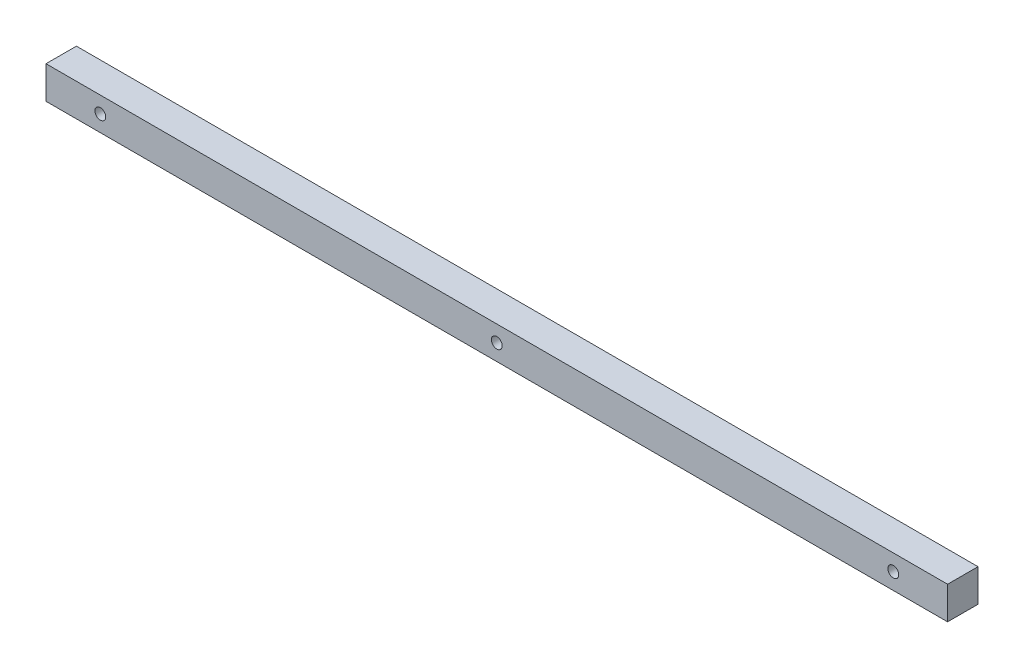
ISO-10303-21;
HEADER;
FILE_DESCRIPTION(('STEP AP214'),'2;1');
FILE_NAME('part.step','',(''),(''),'','','');
FILE_SCHEMA(('AUTOMOTIVE_DESIGN { 1 0 10303 214 1 1 1 1 }'));
ENDSEC;
DATA;
#1=APPLICATION_CONTEXT('core data for automotive mechanical design processes');
#2=APPLICATION_PROTOCOL_DEFINITION('international standard','automotive_design',2000,#1);
#3=PRODUCT_CONTEXT('',#1,'mechanical');
#4=PRODUCT('Part','Part','',(#3));
#5=PRODUCT_RELATED_PRODUCT_CATEGORY('part','',(#4));
#6=PRODUCT_DEFINITION_FORMATION('','',#4);
#7=PRODUCT_DEFINITION_CONTEXT('part definition',#1,'design');
#8=PRODUCT_DEFINITION('design','',#6,#7);
#9=PRODUCT_DEFINITION_SHAPE('','',#8);
#10=(LENGTH_UNIT() NAMED_UNIT(*) SI_UNIT(.MILLI.,.METRE.));
#11=(NAMED_UNIT(*) PLANE_ANGLE_UNIT() SI_UNIT($,.RADIAN.));
#12=(NAMED_UNIT(*) SI_UNIT($,.STERADIAN.) SOLID_ANGLE_UNIT());
#13=UNCERTAINTY_MEASURE_WITH_UNIT(LENGTH_MEASURE(1.E-05),#10,'distance_accuracy_value','');
#14=(GEOMETRIC_REPRESENTATION_CONTEXT(3) GLOBAL_UNCERTAINTY_ASSIGNED_CONTEXT((#13)) GLOBAL_UNIT_ASSIGNED_CONTEXT((#10,
#11,#12)) REPRESENTATION_CONTEXT('',''));
#15=CARTESIAN_POINT('',(0.,0.,0.));
#16=DIRECTION('',(0.,0.,1.));
#17=DIRECTION('',(1.,0.,0.));
#18=AXIS2_PLACEMENT_3D('',#15,#16,#17);
#19=CARTESIAN_POINT('',(0.,0.,28.));
#20=DIRECTION('',(0.,0.,1.));
#21=DIRECTION('',(1.,0.,0.));
#22=AXIS2_PLACEMENT_3D('',#19,#20,#21);
#23=PLANE('',#22);
#24=CARTESIAN_POINT('',(-365.,0.,28.));
#25=DIRECTION('',(0.,0.,1.));
#26=DIRECTION('',(1.,0.,0.));
#27=AXIS2_PLACEMENT_3D('',#24,#25,#26);
#28=CIRCLE('',#27,5.00000000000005);
#29=CARTESIAN_POINT('',(-360.,0.,28.));
#30=VERTEX_POINT('',#29);
#31=EDGE_CURVE('E132',#30,#30,#28,.T.);
#32=ORIENTED_EDGE('',*,*,#31,.F.);
#33=EDGE_LOOP('',(#32));
#34=FACE_BOUND('',#33,.T.);
#35=DIRECTION('',(0.,-1.,0.));
#36=VECTOR('',#35,1.);
#37=CARTESIAN_POINT('',(-415.,15.,28.));
#38=LINE('',#37,#36);
#39=CARTESIAN_POINT('',(-415.,15.,28.));
#40=VERTEX_POINT('',#39);
#41=CARTESIAN_POINT('',(-415.,-15.,28.));
#42=VERTEX_POINT('',#41);
#43=EDGE_CURVE('E92',#40,#42,#38,.T.);
#44=ORIENTED_EDGE('',*,*,#43,.T.);
#45=DIRECTION('',(1.,0.,0.));
#46=VECTOR('',#45,1.);
#47=CARTESIAN_POINT('',(-415.,-15.,28.));
#48=LINE('',#47,#46);
#49=CARTESIAN_POINT('',(415.,-15.,28.));
#50=VERTEX_POINT('',#49);
#51=EDGE_CURVE('E87',#42,#50,#48,.T.);
#52=ORIENTED_EDGE('',*,*,#51,.T.);
#53=DIRECTION('',(0.,1.,0.));
#54=VECTOR('',#53,1.);
#55=CARTESIAN_POINT('',(415.,15.,28.));
#56=LINE('',#55,#54);
#57=CARTESIAN_POINT('',(415.,15.,28.));
#58=VERTEX_POINT('',#57);
#59=EDGE_CURVE('E90',#50,#58,#56,.T.);
#60=ORIENTED_EDGE('',*,*,#59,.T.);
#61=DIRECTION('',(-1.,0.,0.));
#62=VECTOR('',#61,1.);
#63=CARTESIAN_POINT('',(-415.,15.,28.));
#64=LINE('',#63,#62);
#65=EDGE_CURVE('E57',#58,#40,#64,.T.);
#66=ORIENTED_EDGE('',*,*,#65,.T.);
#67=EDGE_LOOP('',(#44,#52,#60,#66));
#68=FACE_BOUND('',#67,.T.);
#69=CARTESIAN_POINT('',(365.,0.,28.));
#70=DIRECTION('',(0.,0.,1.));
#71=DIRECTION('',(1.,0.,0.));
#72=AXIS2_PLACEMENT_3D('',#69,#70,#71);
#73=CIRCLE('',#72,4.99999999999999);
#74=CARTESIAN_POINT('',(370.,0.,28.));
#75=VERTEX_POINT('',#74);
#76=EDGE_CURVE('E111',#75,#75,#73,.T.);
#77=ORIENTED_EDGE('',*,*,#76,.F.);
#78=EDGE_LOOP('',(#77));
#79=FACE_BOUND('',#78,.T.);
#80=CARTESIAN_POINT('',(0.,0.,28.));
#81=DIRECTION('',(0.,0.,1.));
#82=DIRECTION('',(1.,0.,0.));
#83=AXIS2_PLACEMENT_3D('',#80,#81,#82);
#84=CIRCLE('',#83,5.);
#85=CARTESIAN_POINT('',(5.00000000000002,0.,28.));
#86=VERTEX_POINT('',#85);
#87=EDGE_CURVE('E139',#86,#86,#84,.T.);
#88=ORIENTED_EDGE('',*,*,#87,.F.);
#89=EDGE_LOOP('',(#88));
#90=FACE_BOUND('',#89,.T.);
#91=ADVANCED_FACE('F39',(#34,#68,#79,#90),#23,.T.);
#92=CARTESIAN_POINT('',(0.,0.,0.));
#93=DIRECTION('',(0.,0.,1.));
#94=DIRECTION('',(1.,0.,0.));
#95=AXIS2_PLACEMENT_3D('',#92,#93,#94);
#96=PLANE('',#95);
#97=DIRECTION('',(0.,-1.,0.));
#98=VECTOR('',#97,1.);
#99=CARTESIAN_POINT('',(-415.,15.,0.));
#100=LINE('',#99,#98);
#101=CARTESIAN_POINT('',(-415.,15.,0.));
#102=VERTEX_POINT('',#101);
#103=CARTESIAN_POINT('',(-415.,-15.,0.));
#104=VERTEX_POINT('',#103);
#105=EDGE_CURVE('E107',#102,#104,#100,.T.);
#106=ORIENTED_EDGE('',*,*,#105,.F.);
#107=DIRECTION('',(-1.,0.,0.));
#108=VECTOR('',#107,1.);
#109=CARTESIAN_POINT('',(-415.,15.,0.));
#110=LINE('',#109,#108);
#111=CARTESIAN_POINT('',(415.,15.,0.));
#112=VERTEX_POINT('',#111);
#113=EDGE_CURVE('E80',#112,#102,#110,.T.);
#114=ORIENTED_EDGE('',*,*,#113,.F.);
#115=DIRECTION('',(0.,1.,0.));
#116=VECTOR('',#115,1.);
#117=CARTESIAN_POINT('',(415.,15.,0.));
#118=LINE('',#117,#116);
#119=CARTESIAN_POINT('',(415.,-15.,0.));
#120=VERTEX_POINT('',#119);
#121=EDGE_CURVE('E74',#120,#112,#118,.T.);
#122=ORIENTED_EDGE('',*,*,#121,.F.);
#123=DIRECTION('',(1.,0.,0.));
#124=VECTOR('',#123,1.);
#125=CARTESIAN_POINT('',(-415.,-15.,0.));
#126=LINE('',#125,#124);
#127=EDGE_CURVE('E97',#104,#120,#126,.T.);
#128=ORIENTED_EDGE('',*,*,#127,.F.);
#129=EDGE_LOOP('',(#106,#114,#122,#128));
#130=FACE_BOUND('',#129,.T.);
#131=CARTESIAN_POINT('',(365.,0.,0.));
#132=DIRECTION('',(0.,0.,1.));
#133=DIRECTION('',(1.,0.,0.));
#134=AXIS2_PLACEMENT_3D('',#131,#132,#133);
#135=CIRCLE('',#134,4.99999999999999);
#136=CARTESIAN_POINT('',(370.,0.,0.));
#137=VERTEX_POINT('',#136);
#138=EDGE_CURVE('E129',#137,#137,#135,.T.);
#139=ORIENTED_EDGE('',*,*,#138,.T.);
#140=EDGE_LOOP('',(#139));
#141=FACE_BOUND('',#140,.T.);
#142=CARTESIAN_POINT('',(-365.,0.,0.));
#143=DIRECTION('',(0.,0.,1.));
#144=DIRECTION('',(1.,0.,0.));
#145=AXIS2_PLACEMENT_3D('',#142,#143,#144);
#146=CIRCLE('',#145,5.00000000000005);
#147=CARTESIAN_POINT('',(-360.,0.,0.));
#148=VERTEX_POINT('',#147);
#149=EDGE_CURVE('E135',#148,#148,#146,.T.);
#150=ORIENTED_EDGE('',*,*,#149,.T.);
#151=EDGE_LOOP('',(#150));
#152=FACE_BOUND('',#151,.T.);
#153=CARTESIAN_POINT('',(0.,0.,0.));
#154=DIRECTION('',(0.,0.,1.));
#155=DIRECTION('',(1.,0.,0.));
#156=AXIS2_PLACEMENT_3D('',#153,#154,#155);
#157=CIRCLE('',#156,5.);
#158=CARTESIAN_POINT('',(5.00000000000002,0.,0.));
#159=VERTEX_POINT('',#158);
#160=EDGE_CURVE('E143',#159,#159,#157,.T.);
#161=ORIENTED_EDGE('',*,*,#160,.T.);
#162=EDGE_LOOP('',(#161));
#163=FACE_BOUND('',#162,.T.);
#164=ADVANCED_FACE('F122',(#130,#141,#152,#163),#96,.F.);
#165=CARTESIAN_POINT('',(-415.,15.,28.));
#166=DIRECTION('',(1.,0.,0.));
#167=DIRECTION('',(0.,0.,-1.));
#168=AXIS2_PLACEMENT_3D('',#165,#166,#167);
#169=PLANE('',#168);
#170=ORIENTED_EDGE('',*,*,#105,.T.);
#171=DIRECTION('',(0.,0.,-1.));
#172=VECTOR('',#171,1.);
#173=CARTESIAN_POINT('',(-415.,-15.,28.));
#174=LINE('',#173,#172);
#175=EDGE_CURVE('E11',#42,#104,#174,.T.);
#176=ORIENTED_EDGE('',*,*,#175,.F.);
#177=ORIENTED_EDGE('',*,*,#43,.F.);
#178=DIRECTION('',(0.,0.,-1.));
#179=VECTOR('',#178,1.);
#180=CARTESIAN_POINT('',(-415.,15.,28.));
#181=LINE('',#180,#179);
#182=EDGE_CURVE('E103',#40,#102,#181,.T.);
#183=ORIENTED_EDGE('',*,*,#182,.T.);
#184=EDGE_LOOP('',(#170,#176,#177,#183));
#185=FACE_BOUND('',#184,.T.);
#186=ADVANCED_FACE('F41',(#185),#169,.F.);
#187=CARTESIAN_POINT('',(-415.,-15.,28.));
#188=DIRECTION('',(0.,1.,0.));
#189=DIRECTION('',(0.,0.,1.));
#190=AXIS2_PLACEMENT_3D('',#187,#188,#189);
#191=PLANE('',#190);
#192=ORIENTED_EDGE('',*,*,#127,.T.);
#193=DIRECTION('',(0.,0.,-1.));
#194=VECTOR('',#193,1.);
#195=CARTESIAN_POINT('',(415.,-15.,28.));
#196=LINE('',#195,#194);
#197=EDGE_CURVE('E49',#50,#120,#196,.T.);
#198=ORIENTED_EDGE('',*,*,#197,.F.);
#199=ORIENTED_EDGE('',*,*,#51,.F.);
#200=ORIENTED_EDGE('',*,*,#175,.T.);
#201=EDGE_LOOP('',(#192,#198,#199,#200));
#202=FACE_BOUND('',#201,.T.);
#203=ADVANCED_FACE('F96',(#202),#191,.F.);
#204=CARTESIAN_POINT('',(415.,15.,28.));
#205=DIRECTION('',(-1.,0.,0.));
#206=DIRECTION('',(0.,0.,1.));
#207=AXIS2_PLACEMENT_3D('',#204,#205,#206);
#208=PLANE('',#207);
#209=ORIENTED_EDGE('',*,*,#121,.T.);
#210=DIRECTION('',(0.,0.,-1.));
#211=VECTOR('',#210,1.);
#212=CARTESIAN_POINT('',(415.,15.,28.));
#213=LINE('',#212,#211);
#214=EDGE_CURVE('E99',#58,#112,#213,.T.);
#215=ORIENTED_EDGE('',*,*,#214,.F.);
#216=ORIENTED_EDGE('',*,*,#59,.F.);
#217=ORIENTED_EDGE('',*,*,#197,.T.);
#218=EDGE_LOOP('',(#209,#215,#216,#217));
#219=FACE_BOUND('',#218,.T.);
#220=ADVANCED_FACE('F100',(#219),#208,.F.);
#221=CARTESIAN_POINT('',(-415.,15.,28.));
#222=DIRECTION('',(0.,-1.,0.));
#223=DIRECTION('',(0.,0.,-1.));
#224=AXIS2_PLACEMENT_3D('',#221,#222,#223);
#225=PLANE('',#224);
#226=ORIENTED_EDGE('',*,*,#113,.T.);
#227=ORIENTED_EDGE('',*,*,#182,.F.);
#228=ORIENTED_EDGE('',*,*,#65,.F.);
#229=ORIENTED_EDGE('',*,*,#214,.T.);
#230=EDGE_LOOP('',(#226,#227,#228,#229));
#231=FACE_BOUND('',#230,.T.);
#232=ADVANCED_FACE('F119',(#231),#225,.F.);
#233=CARTESIAN_POINT('',(365.,0.,28.));
#234=DIRECTION('',(0.,0.,-1.));
#235=DIRECTION('',(-1.,0.,0.));
#236=AXIS2_PLACEMENT_3D('',#233,#234,#235);
#237=CYLINDRICAL_SURFACE('',#236,4.99999999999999);
#238=ORIENTED_EDGE('',*,*,#76,.T.);
#239=EDGE_LOOP('',(#238));
#240=FACE_BOUND('',#239,.T.);
#241=ORIENTED_EDGE('',*,*,#138,.F.);
#242=EDGE_LOOP('',(#241));
#243=FACE_BOUND('',#242,.T.);
#244=ADVANCED_FACE('F163',(#240,#243),#237,.F.);
#245=CARTESIAN_POINT('',(-365.,0.,28.));
#246=DIRECTION('',(0.,0.,-1.));
#247=DIRECTION('',(-1.,0.,0.));
#248=AXIS2_PLACEMENT_3D('',#245,#246,#247);
#249=CYLINDRICAL_SURFACE('',#248,5.00000000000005);
#250=ORIENTED_EDGE('',*,*,#31,.T.);
#251=EDGE_LOOP('',(#250));
#252=FACE_BOUND('',#251,.T.);
#253=ORIENTED_EDGE('',*,*,#149,.F.);
#254=EDGE_LOOP('',(#253));
#255=FACE_BOUND('',#254,.T.);
#256=ADVANCED_FACE('F202',(#252,#255),#249,.F.);
#257=CARTESIAN_POINT('',(0.,0.,28.));
#258=DIRECTION('',(0.,0.,-1.));
#259=DIRECTION('',(-1.,0.,0.));
#260=AXIS2_PLACEMENT_3D('',#257,#258,#259);
#261=CYLINDRICAL_SURFACE('',#260,5.);
#262=ORIENTED_EDGE('',*,*,#87,.T.);
#263=EDGE_LOOP('',(#262));
#264=FACE_BOUND('',#263,.T.);
#265=ORIENTED_EDGE('',*,*,#160,.F.);
#266=EDGE_LOOP('',(#265));
#267=FACE_BOUND('',#266,.T.);
#268=ADVANCED_FACE('F151',(#264,#267),#261,.F.);
#269=CLOSED_SHELL('',(#91,#164,#186,#203,#220,#232,#244,#256,#268));
#270=MANIFOLD_SOLID_BREP('B2',#269);
#271=ADVANCED_BREP_SHAPE_REPRESENTATION('',(#18,#270),#14);
#272=SHAPE_DEFINITION_REPRESENTATION(#9,#271);
ENDSEC;
END-ISO-10303-21;
